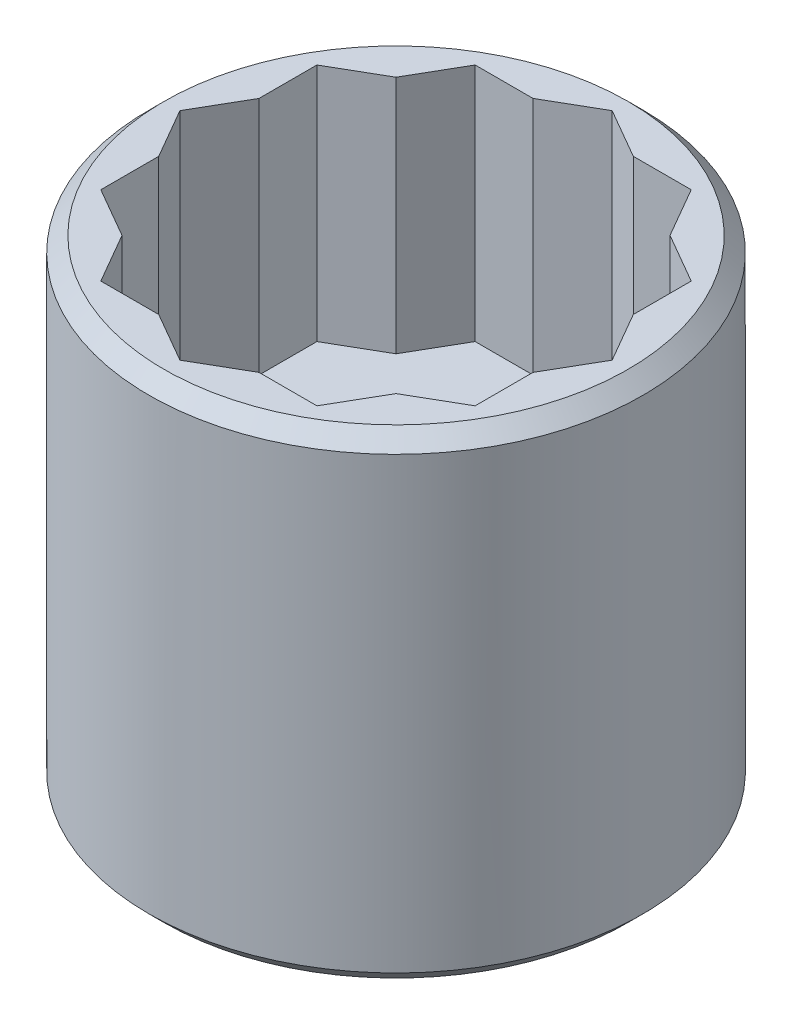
ISO-10303-21;
HEADER;
FILE_DESCRIPTION(('STEP AP214'),'2;1');
FILE_NAME('part.step','',(''),(''),'','','');
FILE_SCHEMA(('AUTOMOTIVE_DESIGN { 1 0 10303 214 1 1 1 1 }'));
ENDSEC;
DATA;
#1=APPLICATION_CONTEXT('core data for automotive mechanical design processes');
#2=APPLICATION_PROTOCOL_DEFINITION('international standard','automotive_design',2000,#1);
#3=PRODUCT_CONTEXT('',#1,'mechanical');
#4=PRODUCT('Part','Part','',(#3));
#5=PRODUCT_RELATED_PRODUCT_CATEGORY('part','',(#4));
#6=PRODUCT_DEFINITION_FORMATION('','',#4);
#7=PRODUCT_DEFINITION_CONTEXT('part definition',#1,'design');
#8=PRODUCT_DEFINITION('design','',#6,#7);
#9=PRODUCT_DEFINITION_SHAPE('','',#8);
#10=(LENGTH_UNIT() NAMED_UNIT(*) SI_UNIT(.MILLI.,.METRE.));
#11=(NAMED_UNIT(*) PLANE_ANGLE_UNIT() SI_UNIT($,.RADIAN.));
#12=(NAMED_UNIT(*) SI_UNIT($,.STERADIAN.) SOLID_ANGLE_UNIT());
#13=UNCERTAINTY_MEASURE_WITH_UNIT(LENGTH_MEASURE(1.E-05),#10,'distance_accuracy_value','');
#14=(GEOMETRIC_REPRESENTATION_CONTEXT(3) GLOBAL_UNCERTAINTY_ASSIGNED_CONTEXT((#13)) GLOBAL_UNIT_ASSIGNED_CONTEXT((#10,
#11,#12)) REPRESENTATION_CONTEXT('',''));
#15=CARTESIAN_POINT('',(0.,0.,0.));
#16=DIRECTION('',(0.,0.,1.));
#17=DIRECTION('',(1.,0.,0.));
#18=AXIS2_PLACEMENT_3D('',#15,#16,#17);
#19=CARTESIAN_POINT('',(5.72839720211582,12.7,9.921875));
#20=DIRECTION('',(0.866025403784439,0.,0.5));
#21=DIRECTION('',(0.5,0.,-0.866025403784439));
#22=AXIS2_PLACEMENT_3D('',#19,#20,#21);
#23=PLANE('',#22);
#24=DIRECTION('',(0.5,0.,-0.866025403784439));
#25=VECTOR('',#24,1.);
#26=CARTESIAN_POINT('',(5.72839720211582,12.7,9.921875));
#27=LINE('',#26,#25);
#28=CARTESIAN_POINT('',(9.921875,12.7,2.65855839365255));
#29=VERTEX_POINT('',#28);
#30=CARTESIAN_POINT('',(11.4567944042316,12.7,0.));
#31=VERTEX_POINT('',#30);
#32=EDGE_CURVE('E361',#29,#31,#27,.T.);
#33=ORIENTED_EDGE('',*,*,#32,.F.);
#34=DIRECTION('',(0.,1.,0.));
#35=VECTOR('',#34,1.);
#36=CARTESIAN_POINT('',(9.921875,12.7,2.65855839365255));
#37=LINE('',#36,#35);
#38=CARTESIAN_POINT('',(9.921875,25.3999999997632,2.65855839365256));
#39=VERTEX_POINT('',#38);
#40=EDGE_CURVE('E334',#29,#39,#37,.T.);
#41=ORIENTED_EDGE('',*,*,#40,.T.);
#42=DIRECTION('',(0.5,0.,-0.866025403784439));
#43=VECTOR('',#42,1.);
#44=CARTESIAN_POINT('',(5.72839720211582,25.4,9.921875));
#45=LINE('',#44,#43);
#46=CARTESIAN_POINT('',(11.4567944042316,25.4,0.));
#47=VERTEX_POINT('',#46);
#48=EDGE_CURVE('E337',#39,#47,#45,.T.);
#49=ORIENTED_EDGE('',*,*,#48,.T.);
#50=DIRECTION('',(0.,1.,0.));
#51=VECTOR('',#50,1.);
#52=CARTESIAN_POINT('',(11.4567944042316,12.7,0.));
#53=LINE('',#52,#51);
#54=EDGE_CURVE('E385',#31,#47,#53,.T.);
#55=ORIENTED_EDGE('',*,*,#54,.F.);
#56=EDGE_LOOP('',(#33,#41,#49,#55));
#57=FACE_BOUND('',#56,.T.);
#58=ADVANCED_FACE('F28',(#57),#23,.F.);
#59=CARTESIAN_POINT('',(-5.72839720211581,12.7,9.921875));
#60=DIRECTION('',(0.,0.,1.));
#61=DIRECTION('',(1.,0.,0.));
#62=AXIS2_PLACEMENT_3D('',#59,#60,#61);
#63=PLANE('',#62);
#64=DIRECTION('',(1.,0.,0.));
#65=VECTOR('',#64,1.);
#66=CARTESIAN_POINT('',(-5.72839720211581,12.7,9.921875));
#67=LINE('',#66,#65);
#68=CARTESIAN_POINT('',(2.65855839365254,12.7,9.921875));
#69=VERTEX_POINT('',#68);
#70=CARTESIAN_POINT('',(5.72839720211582,12.7,9.921875));
#71=VERTEX_POINT('',#70);
#72=EDGE_CURVE('E381',#69,#71,#67,.T.);
#73=ORIENTED_EDGE('',*,*,#72,.F.);
#74=DIRECTION('',(0.,1.,0.));
#75=VECTOR('',#74,1.);
#76=CARTESIAN_POINT('',(2.65855839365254,12.7,9.921875));
#77=LINE('',#76,#75);
#78=CARTESIAN_POINT('',(2.65855839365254,25.3999999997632,9.921875));
#79=VERTEX_POINT('',#78);
#80=EDGE_CURVE('E325',#69,#79,#77,.T.);
#81=ORIENTED_EDGE('',*,*,#80,.T.);
#82=DIRECTION('',(1.,0.,0.));
#83=VECTOR('',#82,1.);
#84=CARTESIAN_POINT('',(-5.72839720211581,25.4,9.921875));
#85=LINE('',#84,#83);
#86=CARTESIAN_POINT('',(5.72839720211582,25.4,9.921875));
#87=VERTEX_POINT('',#86);
#88=EDGE_CURVE('E357',#79,#87,#85,.T.);
#89=ORIENTED_EDGE('',*,*,#88,.T.);
#90=DIRECTION('',(0.,1.,0.));
#91=VECTOR('',#90,1.);
#92=CARTESIAN_POINT('',(5.72839720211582,12.7,9.921875));
#93=LINE('',#92,#91);
#94=EDGE_CURVE('E386',#71,#87,#93,.T.);
#95=ORIENTED_EDGE('',*,*,#94,.F.);
#96=EDGE_LOOP('',(#73,#81,#89,#95));
#97=FACE_BOUND('',#96,.T.);
#98=ADVANCED_FACE('F460',(#97),#63,.F.);
#99=CARTESIAN_POINT('',(-11.4567944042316,12.7,0.));
#100=DIRECTION('',(-0.866025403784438,0.,0.5));
#101=DIRECTION('',(0.5,0.,0.866025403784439));
#102=AXIS2_PLACEMENT_3D('',#99,#100,#101);
#103=PLANE('',#102);
#104=DIRECTION('',(0.5,0.,0.866025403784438));
#105=VECTOR('',#104,1.);
#106=CARTESIAN_POINT('',(-11.4567944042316,12.7,0.));
#107=LINE('',#106,#105);
#108=CARTESIAN_POINT('',(-7.26331660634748,12.7,7.26331660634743));
#109=VERTEX_POINT('',#108);
#110=CARTESIAN_POINT('',(-5.72839720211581,12.7,9.921875));
#111=VERTEX_POINT('',#110);
#112=EDGE_CURVE('E377',#109,#111,#107,.T.);
#113=ORIENTED_EDGE('',*,*,#112,.F.);
#114=DIRECTION('',(0.,1.,0.));
#115=VECTOR('',#114,1.);
#116=CARTESIAN_POINT('',(-7.26331660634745,12.7,7.26331660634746));
#117=LINE('',#116,#115);
#118=CARTESIAN_POINT('',(-7.26331660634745,25.3999999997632,7.26331660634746));
#119=VERTEX_POINT('',#118);
#120=EDGE_CURVE('E319',#109,#119,#117,.T.);
#121=ORIENTED_EDGE('',*,*,#120,.T.);
#122=DIRECTION('',(0.5,0.,0.866025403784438));
#123=VECTOR('',#122,1.);
#124=CARTESIAN_POINT('',(-11.4567944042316,25.4,0.));
#125=LINE('',#124,#123);
#126=CARTESIAN_POINT('',(-5.72839720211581,25.4,9.921875));
#127=VERTEX_POINT('',#126);
#128=EDGE_CURVE('E353',#119,#127,#125,.T.);
#129=ORIENTED_EDGE('',*,*,#128,.T.);
#130=DIRECTION('',(0.,1.,0.));
#131=VECTOR('',#130,1.);
#132=CARTESIAN_POINT('',(-5.72839720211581,12.7,9.921875));
#133=LINE('',#132,#131);
#134=EDGE_CURVE('E390',#111,#127,#133,.T.);
#135=ORIENTED_EDGE('',*,*,#134,.F.);
#136=EDGE_LOOP('',(#113,#121,#129,#135));
#137=FACE_BOUND('',#136,.T.);
#138=ADVANCED_FACE('F476',(#137),#103,.F.);
#139=CARTESIAN_POINT('',(-5.72839720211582,12.7,-9.921875));
#140=DIRECTION('',(-0.866025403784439,0.,-0.5));
#141=DIRECTION('',(-0.5,0.,0.866025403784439));
#142=AXIS2_PLACEMENT_3D('',#139,#140,#141);
#143=PLANE('',#142);
#144=DIRECTION('',(-0.5,0.,0.866025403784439));
#145=VECTOR('',#144,1.);
#146=CARTESIAN_POINT('',(-5.72839720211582,12.7,-9.921875));
#147=LINE('',#146,#145);
#148=CARTESIAN_POINT('',(-9.921875,12.7,-2.65855839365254));
#149=VERTEX_POINT('',#148);
#150=CARTESIAN_POINT('',(-11.4567944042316,12.7,0.));
#151=VERTEX_POINT('',#150);
#152=EDGE_CURVE('E373',#149,#151,#147,.T.);
#153=ORIENTED_EDGE('',*,*,#152,.F.);
#154=DIRECTION('',(0.,1.,0.));
#155=VECTOR('',#154,1.);
#156=CARTESIAN_POINT('',(-9.921875,12.7,-2.65855839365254));
#157=LINE('',#156,#155);
#158=CARTESIAN_POINT('',(-9.921875,25.3999999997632,-2.65855839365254));
#159=VERTEX_POINT('',#158);
#160=EDGE_CURVE('E313',#149,#159,#157,.T.);
#161=ORIENTED_EDGE('',*,*,#160,.T.);
#162=DIRECTION('',(-0.5,0.,0.866025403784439));
#163=VECTOR('',#162,1.);
#164=CARTESIAN_POINT('',(-5.72839720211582,25.4,-9.921875));
#165=LINE('',#164,#163);
#166=CARTESIAN_POINT('',(-11.4567944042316,25.4,0.));
#167=VERTEX_POINT('',#166);
#168=EDGE_CURVE('E349',#159,#167,#165,.T.);
#169=ORIENTED_EDGE('',*,*,#168,.T.);
#170=DIRECTION('',(0.,1.,0.));
#171=VECTOR('',#170,1.);
#172=CARTESIAN_POINT('',(-11.4567944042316,12.7,0.));
#173=LINE('',#172,#171);
#174=EDGE_CURVE('E393',#151,#167,#173,.T.);
#175=ORIENTED_EDGE('',*,*,#174,.F.);
#176=EDGE_LOOP('',(#153,#161,#169,#175));
#177=FACE_BOUND('',#176,.T.);
#178=ADVANCED_FACE('F495',(#177),#143,.F.);
#179=CARTESIAN_POINT('',(5.72839720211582,12.7,-9.921875));
#180=DIRECTION('',(0.,0.,-1.));
#181=DIRECTION('',(-1.,0.,0.));
#182=AXIS2_PLACEMENT_3D('',#179,#180,#181);
#183=PLANE('',#182);
#184=DIRECTION('',(-1.,0.,0.));
#185=VECTOR('',#184,1.);
#186=CARTESIAN_POINT('',(5.72839720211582,12.7,-9.921875));
#187=LINE('',#186,#185);
#188=CARTESIAN_POINT('',(-2.65855839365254,12.7,-9.921875));
#189=VERTEX_POINT('',#188);
#190=CARTESIAN_POINT('',(-5.72839720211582,12.7,-9.921875));
#191=VERTEX_POINT('',#190);
#192=EDGE_CURVE('E369',#189,#191,#187,.T.);
#193=ORIENTED_EDGE('',*,*,#192,.F.);
#194=DIRECTION('',(0.,1.,0.));
#195=VECTOR('',#194,1.);
#196=CARTESIAN_POINT('',(-2.65855839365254,12.7,-9.921875));
#197=LINE('',#196,#195);
#198=CARTESIAN_POINT('',(-2.65855839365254,25.3999999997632,-9.921875));
#199=VERTEX_POINT('',#198);
#200=EDGE_CURVE('E307',#189,#199,#197,.T.);
#201=ORIENTED_EDGE('',*,*,#200,.T.);
#202=DIRECTION('',(-1.,0.,0.));
#203=VECTOR('',#202,1.);
#204=CARTESIAN_POINT('',(5.72839720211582,25.4,-9.921875));
#205=LINE('',#204,#203);
#206=CARTESIAN_POINT('',(-5.72839720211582,25.4,-9.921875));
#207=VERTEX_POINT('',#206);
#208=EDGE_CURVE('E345',#199,#207,#205,.T.);
#209=ORIENTED_EDGE('',*,*,#208,.T.);
#210=DIRECTION('',(0.,1.,0.));
#211=VECTOR('',#210,1.);
#212=CARTESIAN_POINT('',(-5.72839720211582,12.7,-9.921875));
#213=LINE('',#212,#211);
#214=EDGE_CURVE('E396',#191,#207,#213,.T.);
#215=ORIENTED_EDGE('',*,*,#214,.F.);
#216=EDGE_LOOP('',(#193,#201,#209,#215));
#217=FACE_BOUND('',#216,.T.);
#218=ADVANCED_FACE('F513',(#217),#183,.F.);
#219=CARTESIAN_POINT('',(11.4567944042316,12.7,0.));
#220=DIRECTION('',(0.866025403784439,0.,-0.5));
#221=DIRECTION('',(-0.5,0.,-0.866025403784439));
#222=AXIS2_PLACEMENT_3D('',#219,#220,#221);
#223=PLANE('',#222);
#224=DIRECTION('',(-0.5,0.,-0.866025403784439));
#225=VECTOR('',#224,1.);
#226=CARTESIAN_POINT('',(11.4567944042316,25.4,0.));
#227=LINE('',#226,#225);
#228=CARTESIAN_POINT('',(9.921875,25.3999999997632,-2.65855839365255));
#229=VERTEX_POINT('',#228);
#230=EDGE_CURVE('E342',#47,#229,#227,.T.);
#231=ORIENTED_EDGE('',*,*,#230,.T.);
#232=DIRECTION('',(0.,-1.,0.));
#233=VECTOR('',#232,1.);
#234=CARTESIAN_POINT('',(9.921875,12.7,-2.65855839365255));
#235=LINE('',#234,#233);
#236=CARTESIAN_POINT('',(9.921875,12.7,-2.65855839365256));
#237=VERTEX_POINT('',#236);
#238=EDGE_CURVE('E331',#229,#237,#235,.T.);
#239=ORIENTED_EDGE('',*,*,#238,.T.);
#240=DIRECTION('',(-0.5,0.,-0.866025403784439));
#241=VECTOR('',#240,1.);
#242=CARTESIAN_POINT('',(11.4567944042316,12.7,0.));
#243=LINE('',#242,#241);
#244=EDGE_CURVE('E366',#31,#237,#243,.T.);
#245=ORIENTED_EDGE('',*,*,#244,.F.);
#246=ORIENTED_EDGE('',*,*,#54,.T.);
#247=EDGE_LOOP('',(#231,#239,#245,#246));
#248=FACE_BOUND('',#247,.T.);
#249=ADVANCED_FACE('F424',(#248),#223,.F.);
#250=CARTESIAN_POINT('',(0.,25.4,0.));
#251=DIRECTION('',(0.,-1.,0.));
#252=DIRECTION('',(0.,0.,-1.));
#253=AXIS2_PLACEMENT_3D('',#250,#251,#252);
#254=CYLINDRICAL_SURFACE('',#253,13.096875);
#255=CARTESIAN_POINT('',(0.,0.793750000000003,0.));
#256=DIRECTION('',(0.,1.,0.));
#257=DIRECTION('',(0.,0.,1.));
#258=AXIS2_PLACEMENT_3D('',#255,#256,#257);
#259=CIRCLE('',#258,13.096875);
#260=CARTESIAN_POINT('',(0.,0.793750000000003,-13.096875));
#261=VERTEX_POINT('',#260);
#262=EDGE_CURVE('E406',#261,#261,#259,.T.);
#263=CARTESIAN_POINT('',(0.,24.60625,0.));
#264=DIRECTION('',(0.,1.,0.));
#265=DIRECTION('',(0.,0.,1.));
#266=AXIS2_PLACEMENT_3D('',#263,#264,#265);
#267=CIRCLE('',#266,13.096875);
#268=CARTESIAN_POINT('',(0.,24.60625,-13.096875));
#269=VERTEX_POINT('',#268);
#270=EDGE_CURVE('E389',#269,#269,#267,.F.);
#271=CARTESIAN_POINT('',(0.,0.793750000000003,-13.096875));
#272=CARTESIAN_POINT('',(0.,1.041796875,-13.096875));
#273=CARTESIAN_POINT('',(0.,1.28984375,-13.096875));
#274=CARTESIAN_POINT('',(0.,1.7859375,-13.096875));
#275=CARTESIAN_POINT('',(0.,2.033984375,-13.096875));
#276=CARTESIAN_POINT('',(0.,2.530078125,-13.096875));
#277=CARTESIAN_POINT('',(0.,2.778125,-13.096875));
#278=CARTESIAN_POINT('',(0.,3.27421875,-13.096875));
#279=CARTESIAN_POINT('',(0.,3.522265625,-13.096875));
#280=CARTESIAN_POINT('',(0.,4.018359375,-13.096875));
#281=CARTESIAN_POINT('',(0.,4.26640625,-13.096875));
#282=CARTESIAN_POINT('',(0.,4.7625,-13.096875));
#283=CARTESIAN_POINT('',(0.,5.010546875,-13.096875));
#284=CARTESIAN_POINT('',(0.,5.506640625,-13.096875));
#285=CARTESIAN_POINT('',(0.,5.7546875,-13.096875));
#286=CARTESIAN_POINT('',(0.,6.25078125,-13.096875));
#287=CARTESIAN_POINT('',(0.,6.498828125,-13.096875));
#288=CARTESIAN_POINT('',(0.,6.994921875,-13.096875));
#289=CARTESIAN_POINT('',(0.,7.24296875,-13.096875));
#290=CARTESIAN_POINT('',(0.,7.7390625,-13.096875));
#291=CARTESIAN_POINT('',(0.,7.987109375,-13.096875));
#292=CARTESIAN_POINT('',(0.,8.483203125,-13.096875));
#293=CARTESIAN_POINT('',(0.,8.73125,-13.096875));
#294=CARTESIAN_POINT('',(0.,9.22734375,-13.096875));
#295=CARTESIAN_POINT('',(0.,9.475390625,-13.096875));
#296=CARTESIAN_POINT('',(0.,9.971484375,-13.096875));
#297=CARTESIAN_POINT('',(0.,10.21953125,-13.096875));
#298=CARTESIAN_POINT('',(0.,10.715625,-13.096875));
#299=CARTESIAN_POINT('',(0.,10.963671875,-13.096875));
#300=CARTESIAN_POINT('',(0.,11.459765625,-13.096875));
#301=CARTESIAN_POINT('',(0.,11.7078125,-13.096875));
#302=CARTESIAN_POINT('',(0.,12.20390625,-13.096875));
#303=CARTESIAN_POINT('',(0.,12.451953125,-13.096875));
#304=CARTESIAN_POINT('',(0.,12.948046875,-13.096875));
#305=CARTESIAN_POINT('',(0.,13.19609375,-13.096875));
#306=CARTESIAN_POINT('',(0.,13.6921875,-13.096875));
#307=CARTESIAN_POINT('',(0.,13.940234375,-13.096875));
#308=CARTESIAN_POINT('',(0.,14.436328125,-13.096875));
#309=CARTESIAN_POINT('',(0.,14.684375,-13.096875));
#310=CARTESIAN_POINT('',(0.,15.18046875,-13.096875));
#311=CARTESIAN_POINT('',(0.,15.428515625,-13.096875));
#312=CARTESIAN_POINT('',(0.,15.924609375,-13.096875));
#313=CARTESIAN_POINT('',(0.,16.17265625,-13.096875));
#314=CARTESIAN_POINT('',(0.,16.66875,-13.096875));
#315=CARTESIAN_POINT('',(0.,16.916796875,-13.096875));
#316=CARTESIAN_POINT('',(0.,17.412890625,-13.096875));
#317=CARTESIAN_POINT('',(0.,17.6609375,-13.096875));
#318=CARTESIAN_POINT('',(0.,18.15703125,-13.096875));
#319=CARTESIAN_POINT('',(0.,18.405078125,-13.096875));
#320=CARTESIAN_POINT('',(0.,18.901171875,-13.096875));
#321=CARTESIAN_POINT('',(0.,19.14921875,-13.096875));
#322=CARTESIAN_POINT('',(0.,19.6453125,-13.096875));
#323=CARTESIAN_POINT('',(0.,19.893359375,-13.096875));
#324=CARTESIAN_POINT('',(0.,20.389453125,-13.096875));
#325=CARTESIAN_POINT('',(0.,20.6375,-13.096875));
#326=CARTESIAN_POINT('',(0.,21.13359375,-13.096875));
#327=CARTESIAN_POINT('',(0.,21.381640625,-13.096875));
#328=CARTESIAN_POINT('',(0.,21.877734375,-13.096875));
#329=CARTESIAN_POINT('',(0.,22.12578125,-13.096875));
#330=CARTESIAN_POINT('',(0.,22.621875,-13.096875));
#331=CARTESIAN_POINT('',(0.,22.869921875,-13.096875));
#332=CARTESIAN_POINT('',(0.,23.366015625,-13.096875));
#333=CARTESIAN_POINT('',(0.,23.6140625,-13.096875));
#334=CARTESIAN_POINT('',(0.,24.11015625,-13.096875));
#335=CARTESIAN_POINT('',(0.,24.358203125,-13.096875));
#336=CARTESIAN_POINT('',(0.,24.60625,-13.096875));
#337=B_SPLINE_CURVE_WITH_KNOTS('',3,(#271,#272,#273,#274,#275,#276,#277,#278,#279,#280,#281,
#282,#283,#284,#285,#286,#287,#288,#289,#290,#291,#292,#293,#294,#295,#296,#297,#298,#299,#300,
#301,#302,#303,#304,#305,#306,#307,#308,#309,#310,#311,#312,#313,#314,#315,#316,#317,#318,#319,
#320,#321,#322,#323,#324,#325,#326,#327,#328,#329,#330,#331,#332,#333,#334,#335,#336),
.UNSPECIFIED.,.F.,.F.,(4,2,2,2,2,2,2,2,2,2,2,2,2,2,2,2,2,2,2,2,2,2,2,2,2,2,2,2,2,2,2,2,4),(0.,
0.744140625,1.48828125,2.232421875,2.9765625,3.720703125,4.46484375,5.208984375,5.953125,
6.697265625,7.44140625,8.185546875,8.9296875,9.673828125,10.41796875,11.162109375,11.90625,
12.650390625,13.39453125,14.138671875,14.8828125,15.626953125,16.37109375,17.115234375,
17.859375,18.603515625,19.34765625,20.091796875,20.8359375,21.580078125,22.32421875,
23.068359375,23.8125),.UNSPECIFIED.);
#338=EDGE_CURVE('BSEAM30',#261,#269,#337,.T.);
#339=ORIENTED_EDGE('',*,*,#262,.T.);
#340=ORIENTED_EDGE('',*,*,#270,.T.);
#341=ORIENTED_EDGE('',*,*,#338,.T.);
#342=ORIENTED_EDGE('',*,*,#338,.F.);
#343=EDGE_LOOP('',(#339,#341,#340,#342));
#344=FACE_BOUND('',#343,.T.);
#345=ADVANCED_FACE('F30',(#344),#254,.T.);
#346=CARTESIAN_POINT('',(0.,25.4,0.));
#347=DIRECTION('',(0.,1.,0.));
#348=DIRECTION('',(0.,0.,1.));
#349=AXIS2_PLACEMENT_3D('',#346,#347,#348);
#350=PLANE('',#349);
#351=CARTESIAN_POINT('',(0.,25.4,0.));
#352=DIRECTION('',(0.,1.,0.));
#353=DIRECTION('',(0.,0.,1.));
#354=AXIS2_PLACEMENT_3D('',#351,#352,#353);
#355=CIRCLE('',#354,12.303125);
#356=CARTESIAN_POINT('',(0.,25.4,-12.303125));
#357=VERTEX_POINT('',#356);
#358=EDGE_CURVE('E11',#357,#357,#355,.T.);
#359=ORIENTED_EDGE('',*,*,#358,.T.);
#360=EDGE_LOOP('',(#359));
#361=FACE_BOUND('',#360,.T.);
#362=DIRECTION('',(0.,0.,-1.));
#363=VECTOR('',#362,1.);
#364=CARTESIAN_POINT('',(9.921875,25.3999999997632,5.72839720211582));
#365=LINE('',#364,#363);
#366=CARTESIAN_POINT('',(9.921875,25.3999999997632,5.72839720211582));
#367=VERTEX_POINT('',#366);
#368=EDGE_CURVE('E264',#367,#39,#365,.T.);
#369=ORIENTED_EDGE('',*,*,#368,.F.);
#370=DIRECTION('',(0.866025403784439,0.,-0.5));
#371=VECTOR('',#370,1.);
#372=CARTESIAN_POINT('',(0.,25.3999999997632,11.4567944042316));
#373=LINE('',#372,#371);
#374=CARTESIAN_POINT('',(7.26331660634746,25.3999999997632,7.26331660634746));
#375=VERTEX_POINT('',#374);
#376=EDGE_CURVE('E278',#375,#367,#373,.T.);
#377=ORIENTED_EDGE('',*,*,#376,.F.);
#378=EDGE_CURVE('E338',#87,#375,#45,.T.);
#379=ORIENTED_EDGE('',*,*,#378,.F.);
#380=ORIENTED_EDGE('',*,*,#88,.F.);
#381=CARTESIAN_POINT('',(0.,25.3999999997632,11.4567944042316));
#382=VERTEX_POINT('',#381);
#383=EDGE_CURVE('E279',#382,#79,#373,.T.);
#384=ORIENTED_EDGE('',*,*,#383,.F.);
#385=DIRECTION('',(0.866025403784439,0.,0.5));
#386=VECTOR('',#385,1.);
#387=CARTESIAN_POINT('',(-9.921875,25.3999999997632,5.72839720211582));
#388=LINE('',#387,#386);
#389=CARTESIAN_POINT('',(-2.65855839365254,25.3999999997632,9.921875));
#390=VERTEX_POINT('',#389);
#391=EDGE_CURVE('E275',#390,#382,#388,.T.);
#392=ORIENTED_EDGE('',*,*,#391,.F.);
#393=EDGE_CURVE('E358',#127,#390,#85,.T.);
#394=ORIENTED_EDGE('',*,*,#393,.F.);
#395=ORIENTED_EDGE('',*,*,#128,.F.);
#396=CARTESIAN_POINT('',(-9.921875,25.3999999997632,5.72839720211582));
#397=VERTEX_POINT('',#396);
#398=EDGE_CURVE('E276',#397,#119,#388,.T.);
#399=ORIENTED_EDGE('',*,*,#398,.F.);
#400=DIRECTION('',(0.,0.,1.));
#401=VECTOR('',#400,1.);
#402=CARTESIAN_POINT('',(-9.921875,25.3999999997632,-5.72839720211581));
#403=LINE('',#402,#401);
#404=CARTESIAN_POINT('',(-9.921875,25.3999999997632,2.65855839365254));
#405=VERTEX_POINT('',#404);
#406=EDGE_CURVE('E272',#405,#397,#403,.T.);
#407=ORIENTED_EDGE('',*,*,#406,.F.);
#408=EDGE_CURVE('E354',#167,#405,#125,.T.);
#409=ORIENTED_EDGE('',*,*,#408,.F.);
#410=ORIENTED_EDGE('',*,*,#168,.F.);
#411=CARTESIAN_POINT('',(-9.921875,25.3999999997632,-5.72839720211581));
#412=VERTEX_POINT('',#411);
#413=EDGE_CURVE('E273',#412,#159,#403,.T.);
#414=ORIENTED_EDGE('',*,*,#413,.F.);
#415=DIRECTION('',(-0.866025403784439,0.,0.5));
#416=VECTOR('',#415,1.);
#417=CARTESIAN_POINT('',(0.,25.3999999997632,-11.4567944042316));
#418=LINE('',#417,#416);
#419=CARTESIAN_POINT('',(-7.26331660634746,25.3999999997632,-7.26331660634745));
#420=VERTEX_POINT('',#419);
#421=EDGE_CURVE('E269',#420,#412,#418,.T.);
#422=ORIENTED_EDGE('',*,*,#421,.F.);
#423=EDGE_CURVE('E350',#207,#420,#165,.T.);
#424=ORIENTED_EDGE('',*,*,#423,.F.);
#425=ORIENTED_EDGE('',*,*,#208,.F.);
#426=CARTESIAN_POINT('',(0.,25.3999999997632,-11.4567944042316));
#427=VERTEX_POINT('',#426);
#428=EDGE_CURVE('E270',#427,#199,#418,.T.);
#429=ORIENTED_EDGE('',*,*,#428,.F.);
#430=DIRECTION('',(-0.866025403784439,0.,-0.5));
#431=VECTOR('',#430,1.);
#432=CARTESIAN_POINT('',(9.921875,25.3999999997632,-5.72839720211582));
#433=LINE('',#432,#431);
#434=CARTESIAN_POINT('',(2.65855839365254,25.3999999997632,-9.921875));
#435=VERTEX_POINT('',#434);
#436=EDGE_CURVE('E266',#435,#427,#433,.T.);
#437=ORIENTED_EDGE('',*,*,#436,.F.);
#438=CARTESIAN_POINT('',(5.72839720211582,25.4,-9.921875));
#439=VERTEX_POINT('',#438);
#440=EDGE_CURVE('E346',#439,#435,#205,.T.);
#441=ORIENTED_EDGE('',*,*,#440,.F.);
#442=CARTESIAN_POINT('',(7.26331660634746,25.3999999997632,-7.26331660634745));
#443=VERTEX_POINT('',#442);
#444=EDGE_CURVE('E341',#443,#439,#227,.T.);
#445=ORIENTED_EDGE('',*,*,#444,.F.);
#446=CARTESIAN_POINT('',(9.921875,25.3999999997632,-5.72839720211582));
#447=VERTEX_POINT('',#446);
#448=EDGE_CURVE('E267',#447,#443,#433,.T.);
#449=ORIENTED_EDGE('',*,*,#448,.F.);
#450=EDGE_CURVE('E219',#229,#447,#365,.T.);
#451=ORIENTED_EDGE('',*,*,#450,.F.);
#452=ORIENTED_EDGE('',*,*,#230,.F.);
#453=ORIENTED_EDGE('',*,*,#48,.F.);
#454=EDGE_LOOP('',(#369,#377,#379,#380,#384,#392,#394,#395,#399,#407,#409,#410,#414,#422,#424,
#425,#429,#437,#441,#445,#449,#451,#452,#453));
#455=FACE_BOUND('',#454,.T.);
#456=ADVANCED_FACE('F423',(#361,#455),#350,.T.);
#457=CARTESIAN_POINT('',(0.,0.,0.));
#458=DIRECTION('',(0.,1.,0.));
#459=DIRECTION('',(0.,0.,1.));
#460=AXIS2_PLACEMENT_3D('',#457,#458,#459);
#461=PLANE('',#460);
#462=CARTESIAN_POINT('',(0.,0.,0.));
#463=DIRECTION('',(0.,1.,0.));
#464=DIRECTION('',(0.,0.,1.));
#465=AXIS2_PLACEMENT_3D('',#462,#463,#464);
#466=CIRCLE('',#465,12.303125);
#467=CARTESIAN_POINT('',(0.,0.,12.303125));
#468=VERTEX_POINT('',#467);
#469=EDGE_CURVE('E36',#468,#468,#466,.F.);
#470=ORIENTED_EDGE('',*,*,#469,.T.);
#471=EDGE_LOOP('',(#470));
#472=FACE_BOUND('',#471,.T.);
#473=DIRECTION('',(1.,0.,0.));
#474=VECTOR('',#473,1.);
#475=CARTESIAN_POINT('',(-3.175,0.,-3.175));
#476=LINE('',#475,#474);
#477=CARTESIAN_POINT('',(-3.175,0.,-3.175));
#478=VERTEX_POINT('',#477);
#479=CARTESIAN_POINT('',(3.175,0.,-3.175));
#480=VERTEX_POINT('',#479);
#481=EDGE_CURVE('E232',#478,#480,#476,.T.);
#482=ORIENTED_EDGE('',*,*,#481,.F.);
#483=DIRECTION('',(0.,0.,-1.));
#484=VECTOR('',#483,1.);
#485=CARTESIAN_POINT('',(-3.175,0.,3.175));
#486=LINE('',#485,#484);
#487=CARTESIAN_POINT('',(-3.175,0.,3.175));
#488=VERTEX_POINT('',#487);
#489=EDGE_CURVE('E43',#488,#478,#486,.T.);
#490=ORIENTED_EDGE('',*,*,#489,.F.);
#491=DIRECTION('',(-1.,0.,0.));
#492=VECTOR('',#491,1.);
#493=CARTESIAN_POINT('',(-3.175,0.,3.175));
#494=LINE('',#493,#492);
#495=CARTESIAN_POINT('',(3.175,0.,3.175));
#496=VERTEX_POINT('',#495);
#497=EDGE_CURVE('E225',#496,#488,#494,.T.);
#498=ORIENTED_EDGE('',*,*,#497,.F.);
#499=DIRECTION('',(0.,0.,1.));
#500=VECTOR('',#499,1.);
#501=CARTESIAN_POINT('',(3.175,0.,3.175));
#502=LINE('',#501,#500);
#503=EDGE_CURVE('E239',#480,#496,#502,.T.);
#504=ORIENTED_EDGE('',*,*,#503,.F.);
#505=EDGE_LOOP('',(#482,#490,#498,#504));
#506=FACE_BOUND('',#505,.T.);
#507=ADVANCED_FACE('F411',(#472,#506),#461,.F.);
#508=ORIENTED_EDGE('',*,*,#378,.T.);
#509=DIRECTION('',(0.,-1.,0.));
#510=VECTOR('',#509,1.);
#511=CARTESIAN_POINT('',(7.26331660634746,12.7,7.26331660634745));
#512=LINE('',#511,#510);
#513=CARTESIAN_POINT('',(7.26331660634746,12.7,7.26331660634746));
#514=VERTEX_POINT('',#513);
#515=EDGE_CURVE('E328',#375,#514,#512,.T.);
#516=ORIENTED_EDGE('',*,*,#515,.T.);
#517=EDGE_CURVE('E362',#71,#514,#27,.T.);
#518=ORIENTED_EDGE('',*,*,#517,.F.);
#519=ORIENTED_EDGE('',*,*,#94,.T.);
#520=EDGE_LOOP('',(#508,#516,#518,#519));
#521=FACE_BOUND('',#520,.T.);
#522=ADVANCED_FACE('F453',(#521),#23,.F.);
#523=ORIENTED_EDGE('',*,*,#393,.T.);
#524=DIRECTION('',(0.,-1.,0.));
#525=VECTOR('',#524,1.);
#526=CARTESIAN_POINT('',(-2.65855839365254,12.7,9.921875));
#527=LINE('',#526,#525);
#528=CARTESIAN_POINT('',(-2.65855839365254,12.7,9.92187500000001));
#529=VERTEX_POINT('',#528);
#530=EDGE_CURVE('E322',#390,#529,#527,.T.);
#531=ORIENTED_EDGE('',*,*,#530,.T.);
#532=EDGE_CURVE('E382',#111,#529,#67,.T.);
#533=ORIENTED_EDGE('',*,*,#532,.F.);
#534=ORIENTED_EDGE('',*,*,#134,.T.);
#535=EDGE_LOOP('',(#523,#531,#533,#534));
#536=FACE_BOUND('',#535,.T.);
#537=ADVANCED_FACE('F471',(#536),#63,.F.);
#538=ORIENTED_EDGE('',*,*,#408,.T.);
#539=DIRECTION('',(0.,-1.,0.));
#540=VECTOR('',#539,1.);
#541=CARTESIAN_POINT('',(-9.921875,12.7,2.65855839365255));
#542=LINE('',#541,#540);
#543=CARTESIAN_POINT('',(-9.921875,12.7,2.65855839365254));
#544=VERTEX_POINT('',#543);
#545=EDGE_CURVE('E316',#405,#544,#542,.T.);
#546=ORIENTED_EDGE('',*,*,#545,.T.);
#547=EDGE_CURVE('E378',#151,#544,#107,.T.);
#548=ORIENTED_EDGE('',*,*,#547,.F.);
#549=ORIENTED_EDGE('',*,*,#174,.T.);
#550=EDGE_LOOP('',(#538,#546,#548,#549));
#551=FACE_BOUND('',#550,.T.);
#552=ADVANCED_FACE('F489',(#551),#103,.F.);
#553=ORIENTED_EDGE('',*,*,#423,.T.);
#554=DIRECTION('',(0.,-1.,0.));
#555=VECTOR('',#554,1.);
#556=CARTESIAN_POINT('',(-7.26331660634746,12.7,-7.26331660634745));
#557=LINE('',#556,#555);
#558=CARTESIAN_POINT('',(-7.26331660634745,12.7,-7.26331660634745));
#559=VERTEX_POINT('',#558);
#560=EDGE_CURVE('E310',#420,#559,#557,.T.);
#561=ORIENTED_EDGE('',*,*,#560,.T.);
#562=EDGE_CURVE('E374',#191,#559,#147,.T.);
#563=ORIENTED_EDGE('',*,*,#562,.F.);
#564=ORIENTED_EDGE('',*,*,#214,.T.);
#565=EDGE_LOOP('',(#553,#561,#563,#564));
#566=FACE_BOUND('',#565,.T.);
#567=ADVANCED_FACE('F507',(#566),#143,.F.);
#568=ORIENTED_EDGE('',*,*,#440,.T.);
#569=DIRECTION('',(0.,-1.,0.));
#570=VECTOR('',#569,1.);
#571=CARTESIAN_POINT('',(2.65855839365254,12.7,-9.921875));
#572=LINE('',#571,#570);
#573=CARTESIAN_POINT('',(2.65855839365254,12.7,-9.921875));
#574=VERTEX_POINT('',#573);
#575=EDGE_CURVE('E304',#435,#574,#572,.T.);
#576=ORIENTED_EDGE('',*,*,#575,.T.);
#577=CARTESIAN_POINT('',(5.72839720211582,12.7,-9.921875));
#578=VERTEX_POINT('',#577);
#579=EDGE_CURVE('E370',#578,#574,#187,.T.);
#580=ORIENTED_EDGE('',*,*,#579,.F.);
#581=DIRECTION('',(0.,1.,0.));
#582=VECTOR('',#581,1.);
#583=CARTESIAN_POINT('',(5.72839720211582,12.7,-9.921875));
#584=LINE('',#583,#582);
#585=EDGE_CURVE('E399',#578,#439,#584,.T.);
#586=ORIENTED_EDGE('',*,*,#585,.T.);
#587=EDGE_LOOP('',(#568,#576,#580,#586));
#588=FACE_BOUND('',#587,.T.);
#589=ADVANCED_FACE('F527',(#588),#183,.F.);
#590=CARTESIAN_POINT('',(7.26331660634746,12.7,-7.26331660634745));
#591=VERTEX_POINT('',#590);
#592=EDGE_CURVE('E365',#591,#578,#243,.T.);
#593=ORIENTED_EDGE('',*,*,#592,.F.);
#594=DIRECTION('',(0.,1.,0.));
#595=VECTOR('',#594,1.);
#596=CARTESIAN_POINT('',(7.26331660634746,12.7,-7.26331660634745));
#597=LINE('',#596,#595);
#598=EDGE_CURVE('E301',#591,#443,#597,.T.);
#599=ORIENTED_EDGE('',*,*,#598,.T.);
#600=ORIENTED_EDGE('',*,*,#444,.T.);
#601=ORIENTED_EDGE('',*,*,#585,.F.);
#602=EDGE_LOOP('',(#593,#599,#600,#601));
#603=FACE_BOUND('',#602,.T.);
#604=ADVANCED_FACE('F532',(#603),#223,.F.);
#605=CARTESIAN_POINT('',(17.1851916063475,12.7,-9.921875));
#606=DIRECTION('',(0.,1.,0.));
#607=DIRECTION('',(0.,0.,1.));
#608=AXIS2_PLACEMENT_3D('',#605,#606,#607);
#609=PLANE('',#608);
#610=DIRECTION('',(0.,0.,-1.));
#611=VECTOR('',#610,1.);
#612=CARTESIAN_POINT('',(-3.175,12.7,3.175));
#613=LINE('',#612,#611);
#614=CARTESIAN_POINT('',(-3.175,12.7,3.175));
#615=VERTEX_POINT('',#614);
#616=CARTESIAN_POINT('',(-3.175,12.7,-3.175));
#617=VERTEX_POINT('',#616);
#618=EDGE_CURVE('E223',#615,#617,#613,.T.);
#619=ORIENTED_EDGE('',*,*,#618,.T.);
#620=DIRECTION('',(1.,0.,0.));
#621=VECTOR('',#620,1.);
#622=CARTESIAN_POINT('',(-3.175,12.7,-3.175));
#623=LINE('',#622,#621);
#624=CARTESIAN_POINT('',(3.175,12.7,-3.175));
#625=VERTEX_POINT('',#624);
#626=EDGE_CURVE('E212',#617,#625,#623,.T.);
#627=ORIENTED_EDGE('',*,*,#626,.T.);
#628=DIRECTION('',(0.,0.,1.));
#629=VECTOR('',#628,1.);
#630=CARTESIAN_POINT('',(3.175,12.7,3.175));
#631=LINE('',#630,#629);
#632=CARTESIAN_POINT('',(3.175,12.7,3.175));
#633=VERTEX_POINT('',#632);
#634=EDGE_CURVE('E234',#625,#633,#631,.T.);
#635=ORIENTED_EDGE('',*,*,#634,.T.);
#636=DIRECTION('',(-1.,0.,0.));
#637=VECTOR('',#636,1.);
#638=CARTESIAN_POINT('',(-3.175,12.7,3.175));
#639=LINE('',#638,#637);
#640=EDGE_CURVE('E230',#633,#615,#639,.T.);
#641=ORIENTED_EDGE('',*,*,#640,.T.);
#642=EDGE_LOOP('',(#619,#627,#635,#641));
#643=FACE_BOUND('',#642,.T.);
#644=ORIENTED_EDGE('',*,*,#579,.T.);
#645=DIRECTION('',(0.866025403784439,0.,0.5));
#646=VECTOR('',#645,1.);
#647=CARTESIAN_POINT('',(9.921875,12.7,-5.72839720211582));
#648=LINE('',#647,#646);
#649=CARTESIAN_POINT('',(0.,12.7,-11.4567944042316));
#650=VERTEX_POINT('',#649);
#651=EDGE_CURVE('E299',#650,#574,#648,.T.);
#652=ORIENTED_EDGE('',*,*,#651,.F.);
#653=DIRECTION('',(0.866025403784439,0.,-0.5));
#654=VECTOR('',#653,1.);
#655=CARTESIAN_POINT('',(0.,12.7,-11.4567944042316));
#656=LINE('',#655,#654);
#657=EDGE_CURVE('E251',#189,#650,#656,.T.);
#658=ORIENTED_EDGE('',*,*,#657,.F.);
#659=ORIENTED_EDGE('',*,*,#192,.T.);
#660=ORIENTED_EDGE('',*,*,#562,.T.);
#661=CARTESIAN_POINT('',(-9.921875,12.7,-5.72839720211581));
#662=VERTEX_POINT('',#661);
#663=EDGE_CURVE('E248',#662,#559,#656,.T.);
#664=ORIENTED_EDGE('',*,*,#663,.F.);
#665=DIRECTION('',(0.,0.,-1.));
#666=VECTOR('',#665,1.);
#667=CARTESIAN_POINT('',(-9.921875,12.7,-5.72839720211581));
#668=LINE('',#667,#666);
#669=EDGE_CURVE('E250',#149,#662,#668,.T.);
#670=ORIENTED_EDGE('',*,*,#669,.F.);
#671=ORIENTED_EDGE('',*,*,#152,.T.);
#672=ORIENTED_EDGE('',*,*,#547,.T.);
#673=CARTESIAN_POINT('',(-9.921875,12.7,5.72839720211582));
#674=VERTEX_POINT('',#673);
#675=EDGE_CURVE('E252',#674,#544,#668,.T.);
#676=ORIENTED_EDGE('',*,*,#675,.F.);
#677=DIRECTION('',(-0.866025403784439,0.,-0.5));
#678=VECTOR('',#677,1.);
#679=CARTESIAN_POINT('',(-9.921875,12.7,5.72839720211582));
#680=LINE('',#679,#678);
#681=EDGE_CURVE('E254',#109,#674,#680,.T.);
#682=ORIENTED_EDGE('',*,*,#681,.F.);
#683=ORIENTED_EDGE('',*,*,#112,.T.);
#684=ORIENTED_EDGE('',*,*,#532,.T.);
#685=CARTESIAN_POINT('',(0.,12.7,11.4567944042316));
#686=VERTEX_POINT('',#685);
#687=EDGE_CURVE('E255',#686,#529,#680,.T.);
#688=ORIENTED_EDGE('',*,*,#687,.F.);
#689=DIRECTION('',(-0.866025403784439,0.,0.5));
#690=VECTOR('',#689,1.);
#691=CARTESIAN_POINT('',(0.,12.7,11.4567944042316));
#692=LINE('',#691,#690);
#693=EDGE_CURVE('E257',#69,#686,#692,.T.);
#694=ORIENTED_EDGE('',*,*,#693,.F.);
#695=ORIENTED_EDGE('',*,*,#72,.T.);
#696=ORIENTED_EDGE('',*,*,#517,.T.);
#697=CARTESIAN_POINT('',(9.921875,12.7,5.72839720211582));
#698=VERTEX_POINT('',#697);
#699=EDGE_CURVE('E258',#698,#514,#692,.T.);
#700=ORIENTED_EDGE('',*,*,#699,.F.);
#701=DIRECTION('',(0.,0.,1.));
#702=VECTOR('',#701,1.);
#703=CARTESIAN_POINT('',(9.921875,12.7,5.72839720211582));
#704=LINE('',#703,#702);
#705=EDGE_CURVE('E260',#29,#698,#704,.T.);
#706=ORIENTED_EDGE('',*,*,#705,.F.);
#707=ORIENTED_EDGE('',*,*,#32,.T.);
#708=ORIENTED_EDGE('',*,*,#244,.T.);
#709=CARTESIAN_POINT('',(9.921875,12.7,-5.72839720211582));
#710=VERTEX_POINT('',#709);
#711=EDGE_CURVE('E261',#710,#237,#704,.T.);
#712=ORIENTED_EDGE('',*,*,#711,.F.);
#713=EDGE_CURVE('E263',#591,#710,#648,.T.);
#714=ORIENTED_EDGE('',*,*,#713,.F.);
#715=ORIENTED_EDGE('',*,*,#592,.T.);
#716=EDGE_LOOP('',(#644,#652,#658,#659,#660,#664,#670,#671,#672,#676,#682,#683,#684,#688,#694,
#695,#696,#700,#706,#707,#708,#712,#714,#715));
#717=FACE_BOUND('',#716,.T.);
#718=ADVANCED_FACE('F228',(#643,#717),#609,.T.);
#719=CARTESIAN_POINT('',(9.921875,-17.6118288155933,-5.72839720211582));
#720=DIRECTION('',(0.5,0.,-0.866025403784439));
#721=DIRECTION('',(-0.866025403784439,0.,-0.5));
#722=AXIS2_PLACEMENT_3D('',#719,#720,#721);
#723=PLANE('',#722);
#724=ORIENTED_EDGE('',*,*,#713,.T.);
#725=DIRECTION('',(0.,1.,0.));
#726=VECTOR('',#725,1.);
#727=CARTESIAN_POINT('',(9.921875,-17.6118288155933,-5.72839720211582));
#728=LINE('',#727,#726);
#729=EDGE_CURVE('E281',#710,#447,#728,.T.);
#730=ORIENTED_EDGE('',*,*,#729,.T.);
#731=ORIENTED_EDGE('',*,*,#448,.T.);
#732=ORIENTED_EDGE('',*,*,#598,.F.);
#733=EDGE_LOOP('',(#724,#730,#731,#732));
#734=FACE_BOUND('',#733,.T.);
#735=ADVANCED_FACE('F535',(#734),#723,.F.);
#736=CARTESIAN_POINT('',(9.921875,-17.6118288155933,5.72839720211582));
#737=DIRECTION('',(1.,0.,0.));
#738=DIRECTION('',(0.,0.,-1.));
#739=AXIS2_PLACEMENT_3D('',#736,#737,#738);
#740=PLANE('',#739);
#741=ORIENTED_EDGE('',*,*,#450,.T.);
#742=ORIENTED_EDGE('',*,*,#729,.F.);
#743=ORIENTED_EDGE('',*,*,#711,.T.);
#744=ORIENTED_EDGE('',*,*,#238,.F.);
#745=EDGE_LOOP('',(#741,#742,#743,#744));
#746=FACE_BOUND('',#745,.T.);
#747=ADVANCED_FACE('F538',(#746),#740,.F.);
#748=ORIENTED_EDGE('',*,*,#436,.T.);
#749=DIRECTION('',(0.,1.,0.));
#750=VECTOR('',#749,1.);
#751=CARTESIAN_POINT('',(0.,-17.6118288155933,-11.4567944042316));
#752=LINE('',#751,#750);
#753=EDGE_CURVE('E294',#650,#427,#752,.T.);
#754=ORIENTED_EDGE('',*,*,#753,.F.);
#755=ORIENTED_EDGE('',*,*,#651,.T.);
#756=ORIENTED_EDGE('',*,*,#575,.F.);
#757=EDGE_LOOP('',(#748,#754,#755,#756));
#758=FACE_BOUND('',#757,.T.);
#759=ADVANCED_FACE('F522',(#758),#723,.F.);
#760=CARTESIAN_POINT('',(0.,-17.6118288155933,-11.4567944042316));
#761=DIRECTION('',(-0.5,0.,-0.866025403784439));
#762=DIRECTION('',(-0.866025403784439,0.,0.5));
#763=AXIS2_PLACEMENT_3D('',#760,#761,#762);
#764=PLANE('',#763);
#765=ORIENTED_EDGE('',*,*,#657,.T.);
#766=ORIENTED_EDGE('',*,*,#753,.T.);
#767=ORIENTED_EDGE('',*,*,#428,.T.);
#768=ORIENTED_EDGE('',*,*,#200,.F.);
#769=EDGE_LOOP('',(#765,#766,#767,#768));
#770=FACE_BOUND('',#769,.T.);
#771=ADVANCED_FACE('F519',(#770),#764,.F.);
#772=ORIENTED_EDGE('',*,*,#421,.T.);
#773=DIRECTION('',(0.,1.,0.));
#774=VECTOR('',#773,1.);
#775=CARTESIAN_POINT('',(-9.921875,-17.6118288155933,-5.72839720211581));
#776=LINE('',#775,#774);
#777=EDGE_CURVE('E291',#662,#412,#776,.T.);
#778=ORIENTED_EDGE('',*,*,#777,.F.);
#779=ORIENTED_EDGE('',*,*,#663,.T.);
#780=ORIENTED_EDGE('',*,*,#560,.F.);
#781=EDGE_LOOP('',(#772,#778,#779,#780));
#782=FACE_BOUND('',#781,.T.);
#783=ADVANCED_FACE('F504',(#782),#764,.F.);
#784=CARTESIAN_POINT('',(-9.921875,-17.6118288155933,-5.72839720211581));
#785=DIRECTION('',(-1.,0.,0.));
#786=DIRECTION('',(0.,0.,1.));
#787=AXIS2_PLACEMENT_3D('',#784,#785,#786);
#788=PLANE('',#787);
#789=ORIENTED_EDGE('',*,*,#669,.T.);
#790=ORIENTED_EDGE('',*,*,#777,.T.);
#791=ORIENTED_EDGE('',*,*,#413,.T.);
#792=ORIENTED_EDGE('',*,*,#160,.F.);
#793=EDGE_LOOP('',(#789,#790,#791,#792));
#794=FACE_BOUND('',#793,.T.);
#795=ADVANCED_FACE('F501',(#794),#788,.F.);
#796=ORIENTED_EDGE('',*,*,#406,.T.);
#797=DIRECTION('',(0.,1.,0.));
#798=VECTOR('',#797,1.);
#799=CARTESIAN_POINT('',(-9.921875,-17.6118288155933,5.72839720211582));
#800=LINE('',#799,#798);
#801=EDGE_CURVE('E288',#674,#397,#800,.T.);
#802=ORIENTED_EDGE('',*,*,#801,.F.);
#803=ORIENTED_EDGE('',*,*,#675,.T.);
#804=ORIENTED_EDGE('',*,*,#545,.F.);
#805=EDGE_LOOP('',(#796,#802,#803,#804));
#806=FACE_BOUND('',#805,.T.);
#807=ADVANCED_FACE('F486',(#806),#788,.F.);
#808=CARTESIAN_POINT('',(-9.921875,-17.6118288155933,5.72839720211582));
#809=DIRECTION('',(-0.5,0.,0.866025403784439));
#810=DIRECTION('',(0.866025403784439,0.,0.5));
#811=AXIS2_PLACEMENT_3D('',#808,#809,#810);
#812=PLANE('',#811);
#813=ORIENTED_EDGE('',*,*,#681,.T.);
#814=ORIENTED_EDGE('',*,*,#801,.T.);
#815=ORIENTED_EDGE('',*,*,#398,.T.);
#816=ORIENTED_EDGE('',*,*,#120,.F.);
#817=EDGE_LOOP('',(#813,#814,#815,#816));
#818=FACE_BOUND('',#817,.T.);
#819=ADVANCED_FACE('F482',(#818),#812,.F.);
#820=ORIENTED_EDGE('',*,*,#391,.T.);
#821=DIRECTION('',(0.,1.,0.));
#822=VECTOR('',#821,1.);
#823=CARTESIAN_POINT('',(0.,-17.6118288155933,11.4567944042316));
#824=LINE('',#823,#822);
#825=EDGE_CURVE('E285',#686,#382,#824,.T.);
#826=ORIENTED_EDGE('',*,*,#825,.F.);
#827=ORIENTED_EDGE('',*,*,#687,.T.);
#828=ORIENTED_EDGE('',*,*,#530,.F.);
#829=EDGE_LOOP('',(#820,#826,#827,#828));
#830=FACE_BOUND('',#829,.T.);
#831=ADVANCED_FACE('F467',(#830),#812,.F.);
#832=CARTESIAN_POINT('',(0.,-17.6118288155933,11.4567944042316));
#833=DIRECTION('',(0.5,0.,0.866025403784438));
#834=DIRECTION('',(0.866025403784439,0.,-0.5));
#835=AXIS2_PLACEMENT_3D('',#832,#833,#834);
#836=PLANE('',#835);
#837=ORIENTED_EDGE('',*,*,#693,.T.);
#838=ORIENTED_EDGE('',*,*,#825,.T.);
#839=ORIENTED_EDGE('',*,*,#383,.T.);
#840=ORIENTED_EDGE('',*,*,#80,.F.);
#841=EDGE_LOOP('',(#837,#838,#839,#840));
#842=FACE_BOUND('',#841,.T.);
#843=ADVANCED_FACE('F463',(#842),#836,.F.);
#844=ORIENTED_EDGE('',*,*,#705,.T.);
#845=DIRECTION('',(0.,1.,0.));
#846=VECTOR('',#845,1.);
#847=CARTESIAN_POINT('',(9.921875,-17.6118288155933,5.72839720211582));
#848=LINE('',#847,#846);
#849=EDGE_CURVE('E282',#698,#367,#848,.T.);
#850=ORIENTED_EDGE('',*,*,#849,.T.);
#851=ORIENTED_EDGE('',*,*,#368,.T.);
#852=ORIENTED_EDGE('',*,*,#40,.F.);
#853=EDGE_LOOP('',(#844,#850,#851,#852));
#854=FACE_BOUND('',#853,.T.);
#855=ADVANCED_FACE('F441',(#854),#740,.F.);
#856=ORIENTED_EDGE('',*,*,#376,.T.);
#857=ORIENTED_EDGE('',*,*,#849,.F.);
#858=ORIENTED_EDGE('',*,*,#699,.T.);
#859=ORIENTED_EDGE('',*,*,#515,.F.);
#860=EDGE_LOOP('',(#856,#857,#858,#859));
#861=FACE_BOUND('',#860,.T.);
#862=ADVANCED_FACE('F451',(#861),#836,.F.);
#863=CARTESIAN_POINT('',(-3.175,25.401,3.175));
#864=DIRECTION('',(-1.,0.,0.));
#865=DIRECTION('',(0.,0.,1.));
#866=AXIS2_PLACEMENT_3D('',#863,#864,#865);
#867=PLANE('',#866);
#868=DIRECTION('',(0.,-1.,0.));
#869=VECTOR('',#868,1.);
#870=CARTESIAN_POINT('',(-3.175,25.401,3.175));
#871=LINE('',#870,#869);
#872=EDGE_CURVE('E220',#615,#488,#871,.T.);
#873=ORIENTED_EDGE('',*,*,#872,.T.);
#874=ORIENTED_EDGE('',*,*,#489,.T.);
#875=DIRECTION('',(0.,-1.,0.));
#876=VECTOR('',#875,1.);
#877=CARTESIAN_POINT('',(-3.175,25.401,-3.175));
#878=LINE('',#877,#876);
#879=EDGE_CURVE('E214',#617,#478,#878,.T.);
#880=ORIENTED_EDGE('',*,*,#879,.F.);
#881=ORIENTED_EDGE('',*,*,#618,.F.);
#882=EDGE_LOOP('',(#873,#874,#880,#881));
#883=FACE_BOUND('',#882,.T.);
#884=ADVANCED_FACE('F222',(#883),#867,.F.);
#885=CARTESIAN_POINT('',(-3.175,25.401,3.175));
#886=DIRECTION('',(0.,0.,1.));
#887=DIRECTION('',(1.,0.,0.));
#888=AXIS2_PLACEMENT_3D('',#885,#886,#887);
#889=PLANE('',#888);
#890=DIRECTION('',(0.,-1.,0.));
#891=VECTOR('',#890,1.);
#892=CARTESIAN_POINT('',(3.175,25.401,3.175));
#893=LINE('',#892,#891);
#894=EDGE_CURVE('E245',#633,#496,#893,.T.);
#895=ORIENTED_EDGE('',*,*,#894,.T.);
#896=ORIENTED_EDGE('',*,*,#497,.T.);
#897=ORIENTED_EDGE('',*,*,#872,.F.);
#898=ORIENTED_EDGE('',*,*,#640,.F.);
#899=EDGE_LOOP('',(#895,#896,#897,#898));
#900=FACE_BOUND('',#899,.T.);
#901=ADVANCED_FACE('F585',(#900),#889,.F.);
#902=CARTESIAN_POINT('',(3.175,25.401,3.175));
#903=DIRECTION('',(1.,0.,0.));
#904=DIRECTION('',(0.,0.,-1.));
#905=AXIS2_PLACEMENT_3D('',#902,#903,#904);
#906=PLANE('',#905);
#907=DIRECTION('',(0.,-1.,0.));
#908=VECTOR('',#907,1.);
#909=CARTESIAN_POINT('',(3.175,25.401,-3.175));
#910=LINE('',#909,#908);
#911=EDGE_CURVE('E51',#625,#480,#910,.T.);
#912=ORIENTED_EDGE('',*,*,#911,.T.);
#913=ORIENTED_EDGE('',*,*,#503,.T.);
#914=ORIENTED_EDGE('',*,*,#894,.F.);
#915=ORIENTED_EDGE('',*,*,#634,.F.);
#916=EDGE_LOOP('',(#912,#913,#914,#915));
#917=FACE_BOUND('',#916,.T.);
#918=ADVANCED_FACE('F578',(#917),#906,.F.);
#919=CARTESIAN_POINT('',(-3.175,25.401,-3.175));
#920=DIRECTION('',(0.,0.,-1.));
#921=DIRECTION('',(-1.,0.,0.));
#922=AXIS2_PLACEMENT_3D('',#919,#920,#921);
#923=PLANE('',#922);
#924=ORIENTED_EDGE('',*,*,#879,.T.);
#925=ORIENTED_EDGE('',*,*,#481,.T.);
#926=ORIENTED_EDGE('',*,*,#911,.F.);
#927=ORIENTED_EDGE('',*,*,#626,.F.);
#928=EDGE_LOOP('',(#924,#925,#926,#927));
#929=FACE_BOUND('',#928,.T.);
#930=ADVANCED_FACE('F213',(#929),#923,.F.);
#931=CARTESIAN_POINT('',(0.,0.793750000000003,0.));
#932=DIRECTION('',(0.,1.,0.));
#933=DIRECTION('',(0.,0.,1.));
#934=AXIS2_PLACEMENT_3D('',#931,#932,#933);
#935=CONICAL_SURFACE('',#934,13.096875,0.785398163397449);
#936=ORIENTED_EDGE('',*,*,#469,.F.);
#937=EDGE_LOOP('',(#936));
#938=FACE_BOUND('',#937,.T.);
#939=ORIENTED_EDGE('',*,*,#262,.F.);
#940=EDGE_LOOP('',(#939));
#941=FACE_BOUND('',#940,.T.);
#942=ADVANCED_FACE('F414',(#938,#941),#935,.T.);
#943=CARTESIAN_POINT('',(0.,25.4,0.));
#944=DIRECTION('',(0.,-1.,0.));
#945=DIRECTION('',(0.,0.,-1.));
#946=AXIS2_PLACEMENT_3D('',#943,#944,#945);
#947=CONICAL_SURFACE('',#946,12.303125,0.785398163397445);
#948=CARTESIAN_POINT('',(0.,24.60625,-13.096875));
#949=CARTESIAN_POINT('',(0.,24.6145182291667,-13.0886067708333));
#950=CARTESIAN_POINT('',(0.,24.6227864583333,-13.0803385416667));
#951=CARTESIAN_POINT('',(0.,24.6393229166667,-13.0638020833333));
#952=CARTESIAN_POINT('',(0.,24.6475911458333,-13.0555338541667));
#953=CARTESIAN_POINT('',(0.,24.6641276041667,-13.0389973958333));
#954=CARTESIAN_POINT('',(0.,24.6723958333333,-13.0307291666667));
#955=CARTESIAN_POINT('',(0.,24.6889322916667,-13.0141927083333));
#956=CARTESIAN_POINT('',(0.,24.6972005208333,-13.0059244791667));
#957=CARTESIAN_POINT('',(0.,24.7137369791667,-12.9893880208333));
#958=CARTESIAN_POINT('',(0.,24.7220052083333,-12.9811197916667));
#959=CARTESIAN_POINT('',(0.,24.7385416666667,-12.9645833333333));
#960=CARTESIAN_POINT('',(0.,24.7468098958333,-12.9563151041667));
#961=CARTESIAN_POINT('',(0.,24.7633463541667,-12.9397786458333));
#962=CARTESIAN_POINT('',(0.,24.7716145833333,-12.9315104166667));
#963=CARTESIAN_POINT('',(0.,24.7881510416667,-12.9149739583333));
#964=CARTESIAN_POINT('',(0.,24.7964192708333,-12.9067057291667));
#965=CARTESIAN_POINT('',(0.,24.8129557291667,-12.8901692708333));
#966=CARTESIAN_POINT('',(0.,24.8212239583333,-12.8819010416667));
#967=CARTESIAN_POINT('',(0.,24.8377604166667,-12.8653645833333));
#968=CARTESIAN_POINT('',(0.,24.8460286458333,-12.8570963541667));
#969=CARTESIAN_POINT('',(0.,24.8625651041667,-12.8405598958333));
#970=CARTESIAN_POINT('',(0.,24.8708333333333,-12.8322916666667));
#971=CARTESIAN_POINT('',(0.,24.8873697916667,-12.8157552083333));
#972=CARTESIAN_POINT('',(0.,24.8956380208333,-12.8074869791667));
#973=CARTESIAN_POINT('',(0.,24.9121744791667,-12.7909505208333));
#974=CARTESIAN_POINT('',(0.,24.9204427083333,-12.7826822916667));
#975=CARTESIAN_POINT('',(0.,24.9369791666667,-12.7661458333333));
#976=CARTESIAN_POINT('',(0.,24.9452473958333,-12.7578776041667));
#977=CARTESIAN_POINT('',(0.,24.9617838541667,-12.7413411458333));
#978=CARTESIAN_POINT('',(0.,24.9700520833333,-12.7330729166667));
#979=CARTESIAN_POINT('',(0.,24.9865885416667,-12.7165364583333));
#980=CARTESIAN_POINT('',(0.,24.9948567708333,-12.7082682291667));
#981=CARTESIAN_POINT('',(0.,25.0113932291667,-12.6917317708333));
#982=CARTESIAN_POINT('',(0.,25.0196614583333,-12.6834635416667));
#983=CARTESIAN_POINT('',(0.,25.0361979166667,-12.6669270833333));
#984=CARTESIAN_POINT('',(0.,25.0444661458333,-12.6586588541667));
#985=CARTESIAN_POINT('',(0.,25.0610026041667,-12.6421223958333));
#986=CARTESIAN_POINT('',(0.,25.0692708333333,-12.6338541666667));
#987=CARTESIAN_POINT('',(0.,25.0858072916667,-12.6173177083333));
#988=CARTESIAN_POINT('',(0.,25.0940755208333,-12.6090494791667));
#989=CARTESIAN_POINT('',(0.,25.1106119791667,-12.5925130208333));
#990=CARTESIAN_POINT('',(0.,25.1188802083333,-12.5842447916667));
#991=CARTESIAN_POINT('',(0.,25.1354166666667,-12.5677083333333));
#992=CARTESIAN_POINT('',(0.,25.1436848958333,-12.5594401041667));
#993=CARTESIAN_POINT('',(0.,25.1602213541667,-12.5429036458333));
#994=CARTESIAN_POINT('',(0.,25.1684895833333,-12.5346354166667));
#995=CARTESIAN_POINT('',(0.,25.1850260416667,-12.5180989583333));
#996=CARTESIAN_POINT('',(0.,25.1932942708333,-12.5098307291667));
#997=CARTESIAN_POINT('',(0.,25.2098307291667,-12.4932942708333));
#998=CARTESIAN_POINT('',(0.,25.2180989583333,-12.4850260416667));
#999=CARTESIAN_POINT('',(0.,25.2346354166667,-12.4684895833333));
#1000=CARTESIAN_POINT('',(0.,25.2429036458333,-12.4602213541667));
#1001=CARTESIAN_POINT('',(0.,25.2594401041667,-12.4436848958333));
#1002=CARTESIAN_POINT('',(0.,25.2677083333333,-12.4354166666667));
#1003=CARTESIAN_POINT('',(0.,25.2842447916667,-12.4188802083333));
#1004=CARTESIAN_POINT('',(0.,25.2925130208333,-12.4106119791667));
#1005=CARTESIAN_POINT('',(0.,25.3090494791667,-12.3940755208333));
#1006=CARTESIAN_POINT('',(0.,25.3173177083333,-12.3858072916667));
#1007=CARTESIAN_POINT('',(0.,25.3338541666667,-12.3692708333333));
#1008=CARTESIAN_POINT('',(0.,25.3421223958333,-12.3610026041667));
#1009=CARTESIAN_POINT('',(0.,25.3586588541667,-12.3444661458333));
#1010=CARTESIAN_POINT('',(0.,25.3669270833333,-12.3361979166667));
#1011=CARTESIAN_POINT('',(0.,25.3834635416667,-12.3196614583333));
#1012=CARTESIAN_POINT('',(0.,25.3917317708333,-12.3113932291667));
#1013=CARTESIAN_POINT('',(0.,25.4,-12.303125));
#1014=B_SPLINE_CURVE_WITH_KNOTS('',3,(#948,#949,#950,#951,#952,#953,#954,#955,#956,#957,#958,
#959,#960,#961,#962,#963,#964,#965,#966,#967,#968,#969,#970,#971,#972,#973,#974,#975,#976,#977,
#978,#979,#980,#981,#982,#983,#984,#985,#986,#987,#988,#989,#990,#991,#992,#993,#994,#995,#996,
#997,#998,#999,#1000,#1001,#1002,#1003,#1004,#1005,#1006,#1007,#1008,#1009,#1010,#1011,#1012,
#1013),.UNSPECIFIED.,.F.,.F.,(4,2,2,2,2,2,2,2,2,2,2,2,2,2,2,2,2,2,2,2,2,2,2,2,2,2,2,2,2,2,2,2,
4),(0.,0.0350791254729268,0.0701582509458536,0.105237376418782,0.140316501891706,
0.175395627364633,0.210474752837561,0.245553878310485,0.280633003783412,0.315712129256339,
0.350791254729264,0.385870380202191,0.420949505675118,0.456028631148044,0.49110775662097,
0.526186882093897,0.561266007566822,0.59634513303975,0.631424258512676,0.666503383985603,
0.701582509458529,0.736661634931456,0.771740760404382,0.806819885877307,0.841899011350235,
0.876978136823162,0.912057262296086,0.947136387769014,0.982215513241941,1.01729463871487,
1.05237376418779,1.08745288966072,1.12253201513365),.UNSPECIFIED.);
#1015=EDGE_CURVE('BSEAM417',#269,#357,#1014,.T.);
#1016=ORIENTED_EDGE('',*,*,#270,.F.);
#1017=ORIENTED_EDGE('',*,*,#358,.F.);
#1018=ORIENTED_EDGE('',*,*,#1015,.T.);
#1019=ORIENTED_EDGE('',*,*,#1015,.F.);
#1020=EDGE_LOOP('',(#1016,#1018,#1017,#1019));
#1021=FACE_BOUND('',#1020,.T.);
#1022=ADVANCED_FACE('F417',(#1021),#947,.T.);
#1023=CLOSED_SHELL('',(#58,#98,#138,#178,#218,#249,#345,#456,#507,#522,#537,#552,#567,#589,#604,
#718,#735,#747,#759,#771,#783,#795,#807,#819,#831,#843,#855,#862,#884,#901,#918,#930,#942,#1022));
#1024=MANIFOLD_SOLID_BREP('B2',#1023);
#1025=ADVANCED_BREP_SHAPE_REPRESENTATION('',(#18,#1024),#14);
#1026=SHAPE_DEFINITION_REPRESENTATION(#9,#1025);
ENDSEC;
END-ISO-10303-21;
